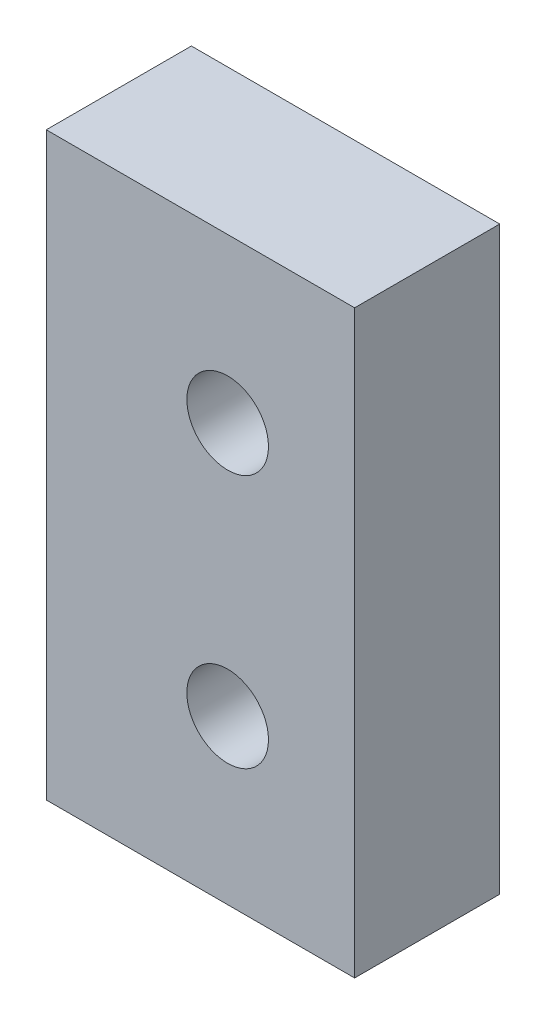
ISO-10303-21;
HEADER;
FILE_DESCRIPTION(('STEP AP214'),'2;1');
FILE_NAME('part.step','',(''),(''),'','','');
FILE_SCHEMA(('AUTOMOTIVE_DESIGN { 1 0 10303 214 1 1 1 1 }'));
ENDSEC;
DATA;
#1=APPLICATION_CONTEXT('core data for automotive mechanical design processes');
#2=APPLICATION_PROTOCOL_DEFINITION('international standard','automotive_design',2000,#1);
#3=PRODUCT_CONTEXT('',#1,'mechanical');
#4=PRODUCT('Part','Part','',(#3));
#5=PRODUCT_RELATED_PRODUCT_CATEGORY('part','',(#4));
#6=PRODUCT_DEFINITION_FORMATION('','',#4);
#7=PRODUCT_DEFINITION_CONTEXT('part definition',#1,'design');
#8=PRODUCT_DEFINITION('design','',#6,#7);
#9=PRODUCT_DEFINITION_SHAPE('','',#8);
#10=(LENGTH_UNIT() NAMED_UNIT(*) SI_UNIT(.MILLI.,.METRE.));
#11=(NAMED_UNIT(*) PLANE_ANGLE_UNIT() SI_UNIT($,.RADIAN.));
#12=(NAMED_UNIT(*) SI_UNIT($,.STERADIAN.) SOLID_ANGLE_UNIT());
#13=UNCERTAINTY_MEASURE_WITH_UNIT(LENGTH_MEASURE(1.E-05),#10,'distance_accuracy_value','');
#14=(GEOMETRIC_REPRESENTATION_CONTEXT(3) GLOBAL_UNCERTAINTY_ASSIGNED_CONTEXT((#13)) GLOBAL_UNIT_ASSIGNED_CONTEXT((#10,
#11,#12)) REPRESENTATION_CONTEXT('',''));
#15=CARTESIAN_POINT('',(0.,0.,0.));
#16=DIRECTION('',(0.,0.,1.));
#17=DIRECTION('',(1.,0.,0.));
#18=AXIS2_PLACEMENT_3D('',#15,#16,#17);
#19=CARTESIAN_POINT('',(17.,-32.,8.));
#20=DIRECTION('',(0.,0.,1.));
#21=DIRECTION('',(1.,0.,0.));
#22=AXIS2_PLACEMENT_3D('',#19,#20,#21);
#23=PLANE('',#22);
#24=CARTESIAN_POINT('',(10.,-9.,8.));
#25=DIRECTION('',(0.,0.,1.));
#26=DIRECTION('',(1.,0.,0.));
#27=AXIS2_PLACEMENT_3D('',#24,#25,#26);
#28=CIRCLE('',#27,2.25);
#29=CARTESIAN_POINT('',(12.25,-9.,8.));
#30=VERTEX_POINT('',#29);
#31=EDGE_CURVE('E99',#30,#30,#28,.T.);
#32=ORIENTED_EDGE('',*,*,#31,.F.);
#33=EDGE_LOOP('',(#32));
#34=FACE_BOUND('',#33,.T.);
#35=DIRECTION('',(1.,0.,0.));
#36=VECTOR('',#35,1.);
#37=CARTESIAN_POINT('',(0.,-32.,8.));
#38=LINE('',#37,#36);
#39=CARTESIAN_POINT('',(0.,-32.,8.));
#40=VERTEX_POINT('',#39);
#41=CARTESIAN_POINT('',(17.,-32.,8.));
#42=VERTEX_POINT('',#41);
#43=EDGE_CURVE('E84',#40,#42,#38,.T.);
#44=ORIENTED_EDGE('',*,*,#43,.T.);
#45=DIRECTION('',(0.,1.,0.));
#46=VECTOR('',#45,1.);
#47=CARTESIAN_POINT('',(17.,-32.,8.));
#48=LINE('',#47,#46);
#49=CARTESIAN_POINT('',(17.,0.,8.));
#50=VERTEX_POINT('',#49);
#51=EDGE_CURVE('E79',#42,#50,#48,.T.);
#52=ORIENTED_EDGE('',*,*,#51,.T.);
#53=DIRECTION('',(-1.,0.,0.));
#54=VECTOR('',#53,1.);
#55=CARTESIAN_POINT('',(0.,0.,8.));
#56=LINE('',#55,#54);
#57=CARTESIAN_POINT('',(0.,0.,8.));
#58=VERTEX_POINT('',#57);
#59=EDGE_CURVE('E82',#50,#58,#56,.T.);
#60=ORIENTED_EDGE('',*,*,#59,.T.);
#61=DIRECTION('',(0.,-1.,0.));
#62=VECTOR('',#61,1.);
#63=CARTESIAN_POINT('',(0.,-32.,8.));
#64=LINE('',#63,#62);
#65=EDGE_CURVE('E49',#58,#40,#64,.T.);
#66=ORIENTED_EDGE('',*,*,#65,.T.);
#67=EDGE_LOOP('',(#44,#52,#60,#66));
#68=FACE_BOUND('',#67,.T.);
#69=CARTESIAN_POINT('',(10.,-23.,8.));
#70=DIRECTION('',(0.,0.,1.));
#71=DIRECTION('',(1.,0.,0.));
#72=AXIS2_PLACEMENT_3D('',#69,#70,#71);
#73=CIRCLE('',#72,2.25);
#74=CARTESIAN_POINT('',(12.25,-23.,8.));
#75=VERTEX_POINT('',#74);
#76=EDGE_CURVE('E114',#75,#75,#73,.T.);
#77=ORIENTED_EDGE('',*,*,#76,.F.);
#78=EDGE_LOOP('',(#77));
#79=FACE_BOUND('',#78,.T.);
#80=ADVANCED_FACE('F32',(#34,#68,#79),#23,.T.);
#81=CARTESIAN_POINT('',(17.,-32.,0.));
#82=DIRECTION('',(0.,0.,1.));
#83=DIRECTION('',(1.,0.,0.));
#84=AXIS2_PLACEMENT_3D('',#81,#82,#83);
#85=PLANE('',#84);
#86=CARTESIAN_POINT('',(10.,-9.,0.));
#87=DIRECTION('',(0.,0.,1.));
#88=DIRECTION('',(1.,0.,0.));
#89=AXIS2_PLACEMENT_3D('',#86,#87,#88);
#90=CIRCLE('',#89,2.25);
#91=CARTESIAN_POINT('',(12.25,-9.,0.));
#92=VERTEX_POINT('',#91);
#93=EDGE_CURVE('E111',#92,#92,#90,.T.);
#94=ORIENTED_EDGE('',*,*,#93,.T.);
#95=EDGE_LOOP('',(#94));
#96=FACE_BOUND('',#95,.T.);
#97=DIRECTION('',(1.,0.,0.));
#98=VECTOR('',#97,1.);
#99=CARTESIAN_POINT('',(0.,-32.,0.));
#100=LINE('',#99,#98);
#101=CARTESIAN_POINT('',(0.,-32.,0.));
#102=VERTEX_POINT('',#101);
#103=CARTESIAN_POINT('',(17.,-32.,0.));
#104=VERTEX_POINT('',#103);
#105=EDGE_CURVE('E96',#102,#104,#100,.T.);
#106=ORIENTED_EDGE('',*,*,#105,.F.);
#107=DIRECTION('',(0.,-1.,0.));
#108=VECTOR('',#107,1.);
#109=CARTESIAN_POINT('',(0.,-32.,0.));
#110=LINE('',#109,#108);
#111=CARTESIAN_POINT('',(0.,0.,0.));
#112=VERTEX_POINT('',#111);
#113=EDGE_CURVE('E72',#112,#102,#110,.T.);
#114=ORIENTED_EDGE('',*,*,#113,.F.);
#115=DIRECTION('',(-1.,0.,0.));
#116=VECTOR('',#115,1.);
#117=CARTESIAN_POINT('',(0.,0.,0.));
#118=LINE('',#117,#116);
#119=CARTESIAN_POINT('',(17.,0.,0.));
#120=VERTEX_POINT('',#119);
#121=EDGE_CURVE('E66',#120,#112,#118,.T.);
#122=ORIENTED_EDGE('',*,*,#121,.F.);
#123=DIRECTION('',(0.,1.,0.));
#124=VECTOR('',#123,1.);
#125=CARTESIAN_POINT('',(17.,-32.,0.));
#126=LINE('',#125,#124);
#127=EDGE_CURVE('E88',#104,#120,#126,.T.);
#128=ORIENTED_EDGE('',*,*,#127,.F.);
#129=EDGE_LOOP('',(#106,#114,#122,#128));
#130=FACE_BOUND('',#129,.T.);
#131=CARTESIAN_POINT('',(10.,-23.,0.));
#132=DIRECTION('',(0.,0.,1.));
#133=DIRECTION('',(1.,0.,0.));
#134=AXIS2_PLACEMENT_3D('',#131,#132,#133);
#135=CIRCLE('',#134,2.25);
#136=CARTESIAN_POINT('',(12.25,-23.,0.));
#137=VERTEX_POINT('',#136);
#138=EDGE_CURVE('E117',#137,#137,#135,.T.);
#139=ORIENTED_EDGE('',*,*,#138,.T.);
#140=EDGE_LOOP('',(#139));
#141=FACE_BOUND('',#140,.T.);
#142=ADVANCED_FACE('F107',(#96,#130,#141),#85,.F.);
#143=CARTESIAN_POINT('',(0.,-32.,8.));
#144=DIRECTION('',(0.,1.,0.));
#145=DIRECTION('',(0.,0.,1.));
#146=AXIS2_PLACEMENT_3D('',#143,#144,#145);
#147=PLANE('',#146);
#148=ORIENTED_EDGE('',*,*,#105,.T.);
#149=DIRECTION('',(0.,0.,-1.));
#150=VECTOR('',#149,1.);
#151=CARTESIAN_POINT('',(17.,-32.,8.));
#152=LINE('',#151,#150);
#153=EDGE_CURVE('E11',#42,#104,#152,.T.);
#154=ORIENTED_EDGE('',*,*,#153,.F.);
#155=ORIENTED_EDGE('',*,*,#43,.F.);
#156=DIRECTION('',(0.,0.,-1.));
#157=VECTOR('',#156,1.);
#158=CARTESIAN_POINT('',(0.,-32.,8.));
#159=LINE('',#158,#157);
#160=EDGE_CURVE('E92',#40,#102,#159,.T.);
#161=ORIENTED_EDGE('',*,*,#160,.T.);
#162=EDGE_LOOP('',(#148,#154,#155,#161));
#163=FACE_BOUND('',#162,.T.);
#164=ADVANCED_FACE('F34',(#163),#147,.F.);
#165=CARTESIAN_POINT('',(17.,-32.,8.));
#166=DIRECTION('',(-1.,0.,0.));
#167=DIRECTION('',(0.,0.,1.));
#168=AXIS2_PLACEMENT_3D('',#165,#166,#167);
#169=PLANE('',#168);
#170=ORIENTED_EDGE('',*,*,#127,.T.);
#171=DIRECTION('',(0.,0.,-1.));
#172=VECTOR('',#171,1.);
#173=CARTESIAN_POINT('',(17.,0.,8.));
#174=LINE('',#173,#172);
#175=EDGE_CURVE('E41',#50,#120,#174,.T.);
#176=ORIENTED_EDGE('',*,*,#175,.F.);
#177=ORIENTED_EDGE('',*,*,#51,.F.);
#178=ORIENTED_EDGE('',*,*,#153,.T.);
#179=EDGE_LOOP('',(#170,#176,#177,#178));
#180=FACE_BOUND('',#179,.T.);
#181=ADVANCED_FACE('F87',(#180),#169,.F.);
#182=CARTESIAN_POINT('',(0.,0.,8.));
#183=DIRECTION('',(0.,-1.,0.));
#184=DIRECTION('',(0.,0.,-1.));
#185=AXIS2_PLACEMENT_3D('',#182,#183,#184);
#186=PLANE('',#185);
#187=ORIENTED_EDGE('',*,*,#121,.T.);
#188=DIRECTION('',(0.,0.,-1.));
#189=VECTOR('',#188,1.);
#190=CARTESIAN_POINT('',(0.,0.,8.));
#191=LINE('',#190,#189);
#192=EDGE_CURVE('E89',#58,#112,#191,.T.);
#193=ORIENTED_EDGE('',*,*,#192,.F.);
#194=ORIENTED_EDGE('',*,*,#59,.F.);
#195=ORIENTED_EDGE('',*,*,#175,.T.);
#196=EDGE_LOOP('',(#187,#193,#194,#195));
#197=FACE_BOUND('',#196,.T.);
#198=ADVANCED_FACE('F90',(#197),#186,.F.);
#199=CARTESIAN_POINT('',(0.,-32.,8.));
#200=DIRECTION('',(1.,0.,0.));
#201=DIRECTION('',(0.,0.,-1.));
#202=AXIS2_PLACEMENT_3D('',#199,#200,#201);
#203=PLANE('',#202);
#204=ORIENTED_EDGE('',*,*,#113,.T.);
#205=ORIENTED_EDGE('',*,*,#160,.F.);
#206=ORIENTED_EDGE('',*,*,#65,.F.);
#207=ORIENTED_EDGE('',*,*,#192,.T.);
#208=EDGE_LOOP('',(#204,#205,#206,#207));
#209=FACE_BOUND('',#208,.T.);
#210=ADVANCED_FACE('F104',(#209),#203,.F.);
#211=CARTESIAN_POINT('',(10.,-9.,8.));
#212=DIRECTION('',(0.,0.,-1.));
#213=DIRECTION('',(-1.,0.,0.));
#214=AXIS2_PLACEMENT_3D('',#211,#212,#213);
#215=CYLINDRICAL_SURFACE('',#214,2.25);
#216=ORIENTED_EDGE('',*,*,#31,.T.);
#217=EDGE_LOOP('',(#216));
#218=FACE_BOUND('',#217,.T.);
#219=ORIENTED_EDGE('',*,*,#93,.F.);
#220=EDGE_LOOP('',(#219));
#221=FACE_BOUND('',#220,.T.);
#222=ADVANCED_FACE('F135',(#218,#221),#215,.F.);
#223=CARTESIAN_POINT('',(10.,-23.,8.));
#224=DIRECTION('',(0.,0.,-1.));
#225=DIRECTION('',(-1.,0.,0.));
#226=AXIS2_PLACEMENT_3D('',#223,#224,#225);
#227=CYLINDRICAL_SURFACE('',#226,2.25);
#228=ORIENTED_EDGE('',*,*,#76,.T.);
#229=EDGE_LOOP('',(#228));
#230=FACE_BOUND('',#229,.T.);
#231=ORIENTED_EDGE('',*,*,#138,.F.);
#232=EDGE_LOOP('',(#231));
#233=FACE_BOUND('',#232,.T.);
#234=ADVANCED_FACE('F123',(#230,#233),#227,.F.);
#235=CLOSED_SHELL('',(#80,#142,#164,#181,#198,#210,#222,#234));
#236=MANIFOLD_SOLID_BREP('B2',#235);
#237=ADVANCED_BREP_SHAPE_REPRESENTATION('',(#18,#236),#14);
#238=SHAPE_DEFINITION_REPRESENTATION(#9,#237);
ENDSEC;
END-ISO-10303-21;
